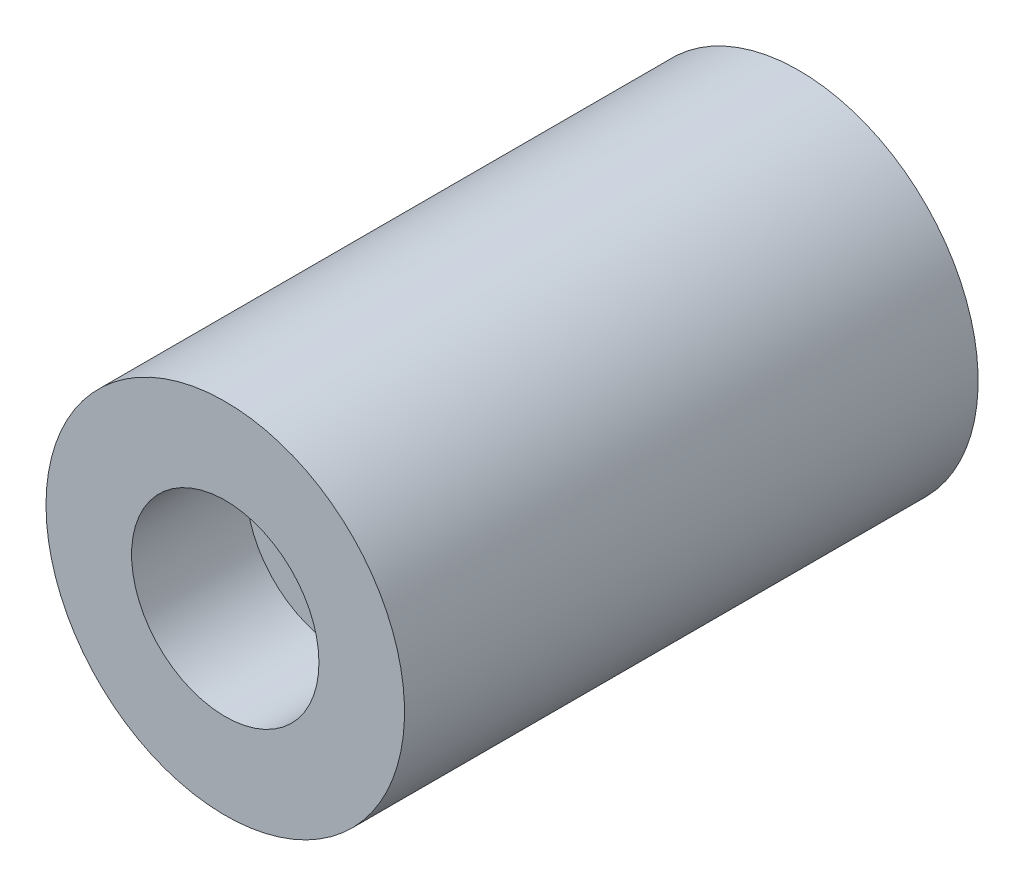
from build123d import *

# Parameters (mm, degrees)
SKETCH1_R                 = 2.38125
EXTRUDE1_DEPTH            = 7.62
SKETCH2_R                 = 1.2446
CUT_EXTRUDE1_DEPTH        = 1.524
F_8_32_TAPPED_HOLE1_D     = 3.4544
F_8_32_TAPPED_HOLE1_DEPTH = 4.826
F_8_32_TAPPED_HOLE1_TIP   = 1.037806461


with BuildPart() as part:
    # Sketch1 → Extrude1 (new body)
    with BuildSketch(Plane.XY):
        with Locations(Location((0, 0, 0), (0, 0, 180))):
            Circle(SKETCH1_R)
    extrude(amount=EXTRUDE1_DEPTH)

    # Sketch2 → Cut-Extrude1 (cut)
    with BuildSketch(Plane.XY.offset(7.62)):
        Circle(SKETCH2_R)
    extrude(amount=-CUT_EXTRUDE1_DEPTH, mode=Mode.SUBTRACT)

    # 8-32 Tapped Hole1
    with Locations(Plane(origin=(0, 0, 0), x_dir=(-1, 0, 0), z_dir=(0, 0, -1))):
        with Locations((0, 0)):
            Hole(F_8_32_TAPPED_HOLE1_D / 2, depth=F_8_32_TAPPED_HOLE1_DEPTH)
            with Locations((0, 0, -(F_8_32_TAPPED_HOLE1_DEPTH + F_8_32_TAPPED_HOLE1_TIP / 2))):  # 118° drill point
                Cone(0, F_8_32_TAPPED_HOLE1_D / 2, F_8_32_TAPPED_HOLE1_TIP, mode=Mode.SUBTRACT)


solid = part.part
